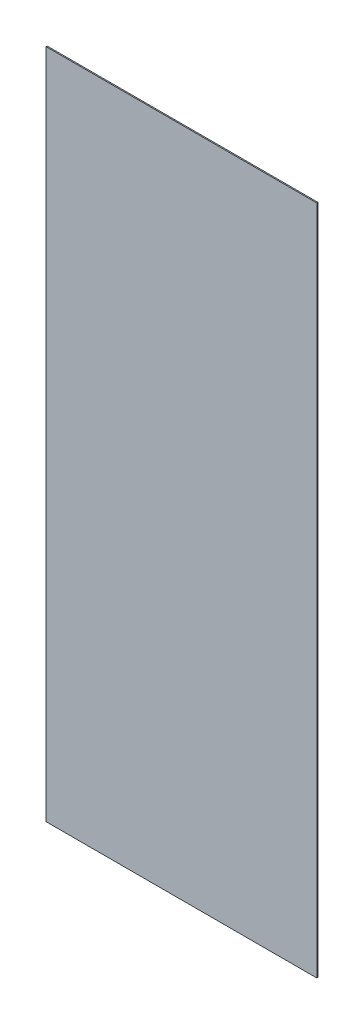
from build123d import *

# Parameters (mm, degrees)
SKETCH1_W      = 614.68
SKETCH1_H      = 1524
EXTRUDE1_DEPTH = 2.54


with BuildPart() as part:
    # Sketch1 → Extrude1 (new body)
    with BuildSketch(Plane.XY):
        with Locations((-304.8, 762)):
            Rectangle(SKETCH1_W, SKETCH1_H)
    extrude(amount=EXTRUDE1_DEPTH)


solid = part.part
